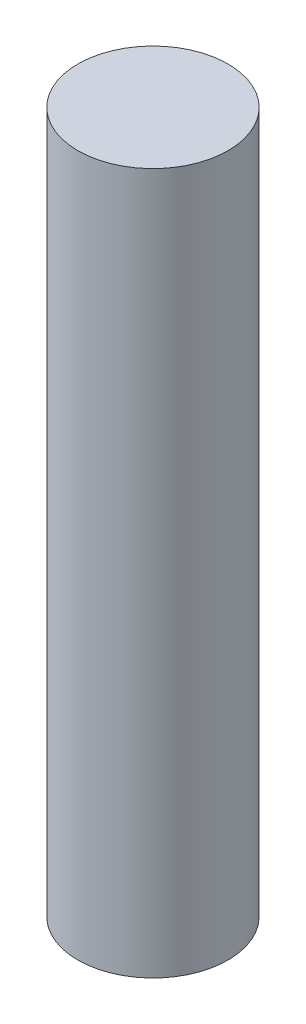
ISO-10303-21;
HEADER;
FILE_DESCRIPTION(('STEP AP214'),'2;1');
FILE_NAME('part.step','',(''),(''),'','','');
FILE_SCHEMA(('AUTOMOTIVE_DESIGN { 1 0 10303 214 1 1 1 1 }'));
ENDSEC;
DATA;
#1=APPLICATION_CONTEXT('core data for automotive mechanical design processes');
#2=APPLICATION_PROTOCOL_DEFINITION('international standard','automotive_design',2000,#1);
#3=PRODUCT_CONTEXT('',#1,'mechanical');
#4=PRODUCT('Part','Part','',(#3));
#5=PRODUCT_RELATED_PRODUCT_CATEGORY('part','',(#4));
#6=PRODUCT_DEFINITION_FORMATION('','',#4);
#7=PRODUCT_DEFINITION_CONTEXT('part definition',#1,'design');
#8=PRODUCT_DEFINITION('design','',#6,#7);
#9=PRODUCT_DEFINITION_SHAPE('','',#8);
#10=(LENGTH_UNIT() NAMED_UNIT(*) SI_UNIT(.MILLI.,.METRE.));
#11=(NAMED_UNIT(*) PLANE_ANGLE_UNIT() SI_UNIT($,.RADIAN.));
#12=(NAMED_UNIT(*) SI_UNIT($,.STERADIAN.) SOLID_ANGLE_UNIT());
#13=UNCERTAINTY_MEASURE_WITH_UNIT(LENGTH_MEASURE(1.E-05),#10,'distance_accuracy_value','');
#14=(GEOMETRIC_REPRESENTATION_CONTEXT(3) GLOBAL_UNCERTAINTY_ASSIGNED_CONTEXT((#13)) GLOBAL_UNIT_ASSIGNED_CONTEXT((#10,
#11,#12)) REPRESENTATION_CONTEXT('',''));
#15=CARTESIAN_POINT('',(0.,0.,0.));
#16=DIRECTION('',(0.,0.,1.));
#17=DIRECTION('',(1.,0.,0.));
#18=AXIS2_PLACEMENT_3D('',#15,#16,#17);
#19=CARTESIAN_POINT('',(0.,0.,0.));
#20=DIRECTION('',(0.,-1.,0.));
#21=DIRECTION('',(0.,0.,-1.));
#22=AXIS2_PLACEMENT_3D('',#19,#20,#21);
#23=PLANE('',#22);
#24=CARTESIAN_POINT('',(0.,0.,0.));
#25=DIRECTION('',(0.,1.,0.));
#26=DIRECTION('',(0.,0.,1.));
#27=AXIS2_PLACEMENT_3D('',#24,#25,#26);
#28=CIRCLE('',#27,3.00000000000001);
#29=CARTESIAN_POINT('',(0.,0.,3.00000000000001));
#30=VERTEX_POINT('',#29);
#31=EDGE_CURVE('E12',#30,#30,#28,.T.);
#32=ORIENTED_EDGE('',*,*,#31,.T.);
#33=EDGE_LOOP('',(#32));
#34=FACE_BOUND('',#33,.T.);
#35=ADVANCED_FACE('F42',(#34),#23,.F.);
#36=CARTESIAN_POINT('',(0.,42.8639573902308,0.));
#37=DIRECTION('',(0.,1.,0.));
#38=DIRECTION('',(0.,0.,1.));
#39=AXIS2_PLACEMENT_3D('',#36,#37,#38);
#40=CYLINDRICAL_SURFACE('',#39,3.00000000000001);
#41=ORIENTED_EDGE('',*,*,#31,.F.);
#42=EDGE_LOOP('',(#41));
#43=FACE_BOUND('',#42,.T.);
#44=CARTESIAN_POINT('',(0.,-28.,0.));
#45=DIRECTION('',(0.,1.,0.));
#46=DIRECTION('',(0.,0.,1.));
#47=AXIS2_PLACEMENT_3D('',#44,#45,#46);
#48=CIRCLE('',#47,3.00000000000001);
#49=CARTESIAN_POINT('',(0.,-28.,3.00000000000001));
#50=VERTEX_POINT('',#49);
#51=EDGE_CURVE('E48',#50,#50,#48,.T.);
#52=ORIENTED_EDGE('',*,*,#51,.T.);
#53=EDGE_LOOP('',(#52));
#54=FACE_BOUND('',#53,.T.);
#55=ADVANCED_FACE('F54',(#43,#54),#40,.T.);
#56=CARTESIAN_POINT('',(0.,-28.,-3.00000000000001));
#57=DIRECTION('',(0.,1.,0.));
#58=DIRECTION('',(0.,0.,1.));
#59=AXIS2_PLACEMENT_3D('',#56,#57,#58);
#60=PLANE('',#59);
#61=ORIENTED_EDGE('',*,*,#51,.F.);
#62=EDGE_LOOP('',(#61));
#63=FACE_BOUND('',#62,.T.);
#64=ADVANCED_FACE('F56',(#63),#60,.F.);
#65=CLOSED_SHELL('',(#35,#55,#64));
#66=MANIFOLD_SOLID_BREP('B2',#65);
#67=ADVANCED_BREP_SHAPE_REPRESENTATION('',(#18,#66),#14);
#68=SHAPE_DEFINITION_REPRESENTATION(#9,#67);
ENDSEC;
END-ISO-10303-21;
